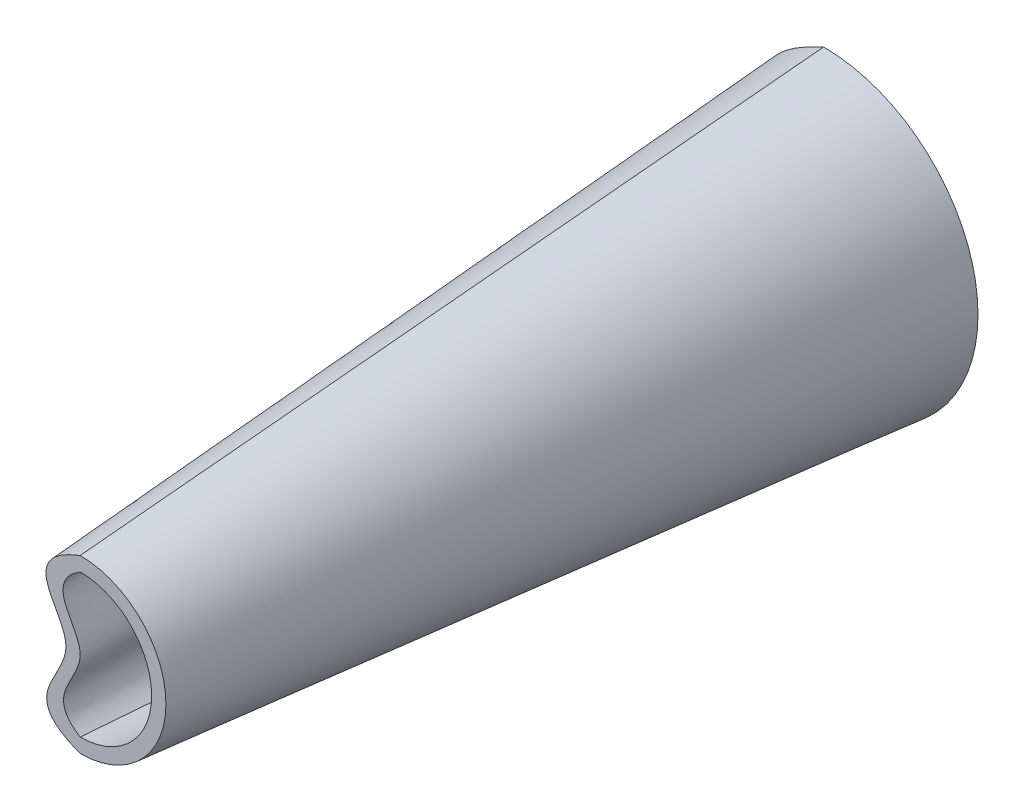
from build123d import *


with BuildPart() as part:
    # Sketch1 → Loft4 section 0
    with BuildSketch(Plane.XY):
        with BuildLine():
            ThreePointArc((0, 38.1), (38.1, 0), (0, -38.1))
            add(Edge.make_bspline(
                [(0, 38.1), (-17.892782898, 31.169006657), (-15.851202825, 18.641053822), (3.041036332, -7.950708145), (-29.295387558, -26.952010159), (0, -38.1)],
                knots=[0, 0, 0, 0, 0.299573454, 0.499714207, 1, 1, 1, 1], degree=3))
        make_face()
    # Sketch2 → Loft4 section 1
    with BuildSketch(Plane.XY.offset(-330.2)):
        with BuildLine():
            ThreePointArc((0, 68.58), (68.58, 0), (0, -68.58))
            add(Edge.make_bspline(
                [(0, 68.58), (-55.056633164, 43.772543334), (41.73272687, 0.365303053), (-53.809348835, -44.4651474), (0, -68.58)],
                knots=[0, 0, 0, 0, 0.500107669, 1, 1, 1, 1], degree=3))
        make_face()
    loft()

    # Sketch1_855 → Cut-Loft1 section 0
    with BuildSketch(Plane.XY):
        with BuildLine():
            ThreePointArc((0, 31.75), (31.75, 0), (0, -31.75))
            add(Edge.make_bspline(
                [(0, 31.75), (-17.054994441, 21.122262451), (16.842868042, 0.131844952), (-16.630686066, -21.391492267), (0, -31.75)],
                knots=[0, 0, 0, 0, 0.499967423, 1, 1, 1, 1], degree=3))
        make_face()
    # Sketch2_1181 → Cut-Loft1 section 1
    with BuildSketch(Plane.XY.offset(-330.2)):
        with BuildLine():
            ThreePointArc((0, 57.15), (57.15, 0), (0, -57.15))
            add(Edge.make_bspline(
                [(0, 57.15), (-35.173417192, 36.096405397), (34.660452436, 0.264321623), (-34.148214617, -36.572223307), (0, -57.15)],
                knots=[0, 0, 0, 0, 0.500181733, 1, 1, 1, 1], degree=3))
        make_face()
    loft(mode=Mode.SUBTRACT)


solid = part.part
